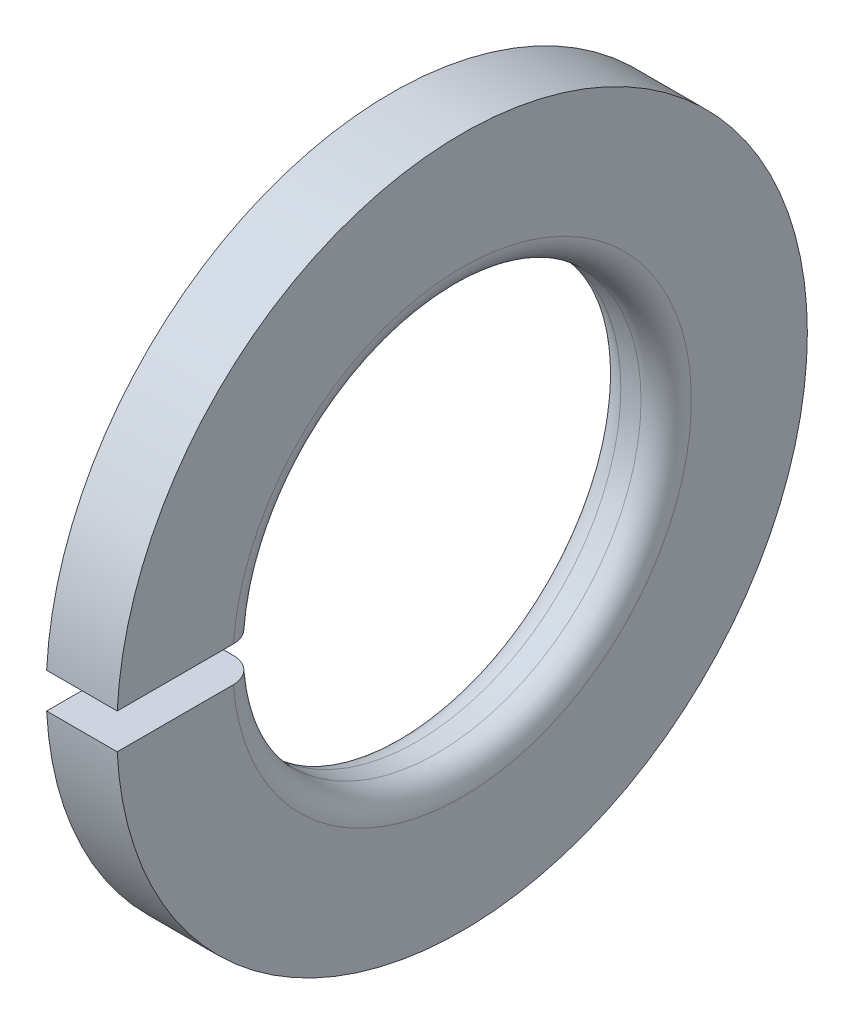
from build123d import *

# Parameters (mm, degrees)
SKETCH2_W = 1.4
SKETCH2_H = 13.974
GAP_DEPTH = 20.576005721


with BuildPart() as part:
    # Sketch1 → Base-Revolve (revolve)
    with BuildSketch(Plane.XY, mode=Mode.PRIVATE) as base_revolve_sk:
        with BuildLine():
            Line((0, 9.1), (0, 13.7))
            Line((0, 13.7), (-2.8, 13.7))
            Line((-2.8, 13.7), (-2.8, 9.1))
            ThreePointArc((-2.8, 9.1), (-2.507106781, 8.392893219), (-1.8, 8.1))
            Line((-1.8, 8.1), (-1, 8.1))
            ThreePointArc((-1, 8.1), (-0.292893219, 8.392893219), (0, 9.1))
        make_face()
    revolve(base_revolve_sk.sketch.rotate(Axis((-34.925, 0, 0), (1, 0, 0)), 90), axis=Axis((-34.925, 0, 0), (1, 0, 0)))

    # Sketch2 → Gap (cut, through all)
    with BuildSketch(Plane(origin=(0, 0, 0), x_dir=(0, -1, 0), z_dir=(-1, 0, 0))):
        with Locations((0, 6.987)):
            Rectangle(SKETCH2_W, SKETCH2_H)
    extrude(amount=GAP_DEPTH, mode=Mode.SUBTRACT)


solid = part.part
